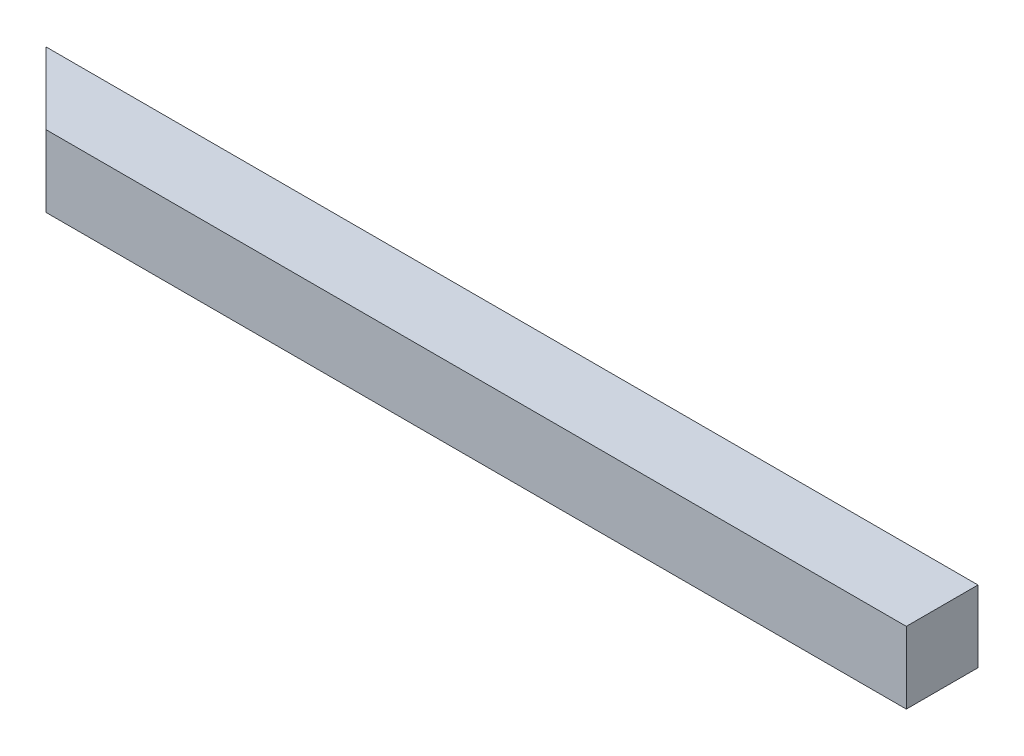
from build123d import *

# Parameters (mm, degrees)
BOSS_EXTRUDE1_DEPTH = 20


with BuildPart() as part:
    # Sketch1 → Boss-Extrude1 (new body)
    with BuildSketch(Plane(origin=(0, 0, 0), x_dir=(1, 0, 0), z_dir=(0, 1, 0))):
        Polygon((-120, 10), (-140, 10), (-120, -10), (120, -10), (120, 10), align=None)
    extrude(amount=BOSS_EXTRUDE1_DEPTH)


solid = part.part
